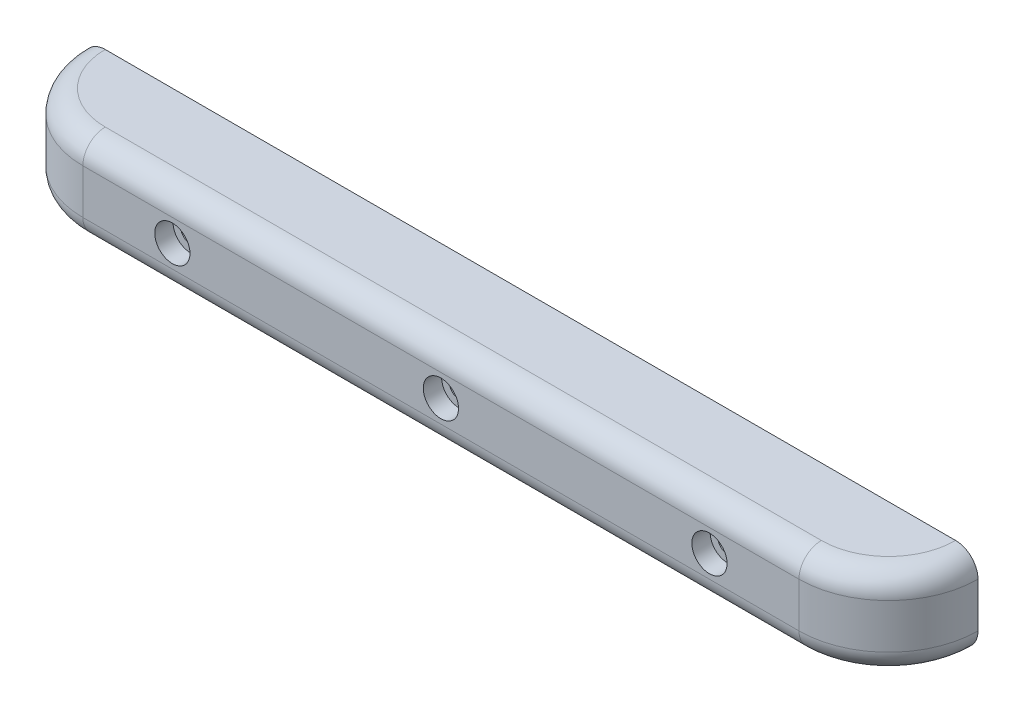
ISO-10303-21;
HEADER;
FILE_DESCRIPTION(('STEP AP214'),'2;1');
FILE_NAME('part.step','',(''),(''),'','','');
FILE_SCHEMA(('AUTOMOTIVE_DESIGN { 1 0 10303 214 1 1 1 1 }'));
ENDSEC;
DATA;
#1=APPLICATION_CONTEXT('core data for automotive mechanical design processes');
#2=APPLICATION_PROTOCOL_DEFINITION('international standard','automotive_design',2000,#1);
#3=PRODUCT_CONTEXT('',#1,'mechanical');
#4=PRODUCT('Part','Part','',(#3));
#5=PRODUCT_RELATED_PRODUCT_CATEGORY('part','',(#4));
#6=PRODUCT_DEFINITION_FORMATION('','',#4);
#7=PRODUCT_DEFINITION_CONTEXT('part definition',#1,'design');
#8=PRODUCT_DEFINITION('design','',#6,#7);
#9=PRODUCT_DEFINITION_SHAPE('','',#8);
#10=(LENGTH_UNIT() NAMED_UNIT(*) SI_UNIT(.MILLI.,.METRE.));
#11=(NAMED_UNIT(*) PLANE_ANGLE_UNIT() SI_UNIT($,.RADIAN.));
#12=(NAMED_UNIT(*) SI_UNIT($,.STERADIAN.) SOLID_ANGLE_UNIT());
#13=UNCERTAINTY_MEASURE_WITH_UNIT(LENGTH_MEASURE(1.E-05),#10,'distance_accuracy_value','');
#14=(GEOMETRIC_REPRESENTATION_CONTEXT(3) GLOBAL_UNCERTAINTY_ASSIGNED_CONTEXT((#13)) GLOBAL_UNIT_ASSIGNED_CONTEXT((#10,
#11,#12)) REPRESENTATION_CONTEXT('',''));
#15=CARTESIAN_POINT('',(0.,0.,0.));
#16=DIRECTION('',(0.,0.,1.));
#17=DIRECTION('',(1.,0.,0.));
#18=AXIS2_PLACEMENT_3D('',#15,#16,#17);
#19=CARTESIAN_POINT('',(-127.,12.7,0.));
#20=DIRECTION('',(0.,0.,-1.));
#21=DIRECTION('',(-1.,0.,0.));
#22=AXIS2_PLACEMENT_3D('',#19,#20,#21);
#23=PLANE('',#22);
#24=CARTESIAN_POINT('',(0.,0.,0.));
#25=DIRECTION('',(0.,0.,1.));
#26=DIRECTION('',(1.,0.,0.));
#27=AXIS2_PLACEMENT_3D('',#24,#25,#26);
#28=CIRCLE('',#27,2.84999999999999);
#29=CARTESIAN_POINT('',(2.84999999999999,0.,0.));
#30=VERTEX_POINT('',#29);
#31=EDGE_CURVE('E288',#30,#30,#28,.T.);
#32=ORIENTED_EDGE('',*,*,#31,.T.);
#33=EDGE_LOOP('',(#32));
#34=FACE_BOUND('',#33,.T.);
#35=DIRECTION('',(1.,0.,0.));
#36=VECTOR('',#35,1.);
#37=CARTESIAN_POINT('',(-127.,-12.7,0.));
#38=LINE('',#37,#36);
#39=CARTESIAN_POINT('',(-120.65,-12.7,0.));
#40=VERTEX_POINT('',#39);
#41=CARTESIAN_POINT('',(120.65,-12.7,0.));
#42=VERTEX_POINT('',#41);
#43=EDGE_CURVE('E126',#40,#42,#38,.T.);
#44=ORIENTED_EDGE('',*,*,#43,.F.);
#45=CARTESIAN_POINT('',(-120.65,-6.35,0.));
#46=DIRECTION('',(0.,0.,-1.));
#47=DIRECTION('',(-1.,0.,0.));
#48=AXIS2_PLACEMENT_3D('',#45,#46,#47);
#49=CIRCLE('',#48,6.35);
#50=CARTESIAN_POINT('',(-127.,-6.35,0.));
#51=VERTEX_POINT('',#50);
#52=EDGE_CURVE('E125',#40,#51,#49,.T.);
#53=ORIENTED_EDGE('',*,*,#52,.T.);
#54=DIRECTION('',(0.,-1.,0.));
#55=VECTOR('',#54,1.);
#56=CARTESIAN_POINT('',(-127.,-12.7,0.));
#57=LINE('',#56,#55);
#58=CARTESIAN_POINT('',(-127.,6.35,0.));
#59=VERTEX_POINT('',#58);
#60=EDGE_CURVE('E109',#59,#51,#57,.T.);
#61=ORIENTED_EDGE('',*,*,#60,.F.);
#62=CARTESIAN_POINT('',(-120.65,6.35,0.));
#63=DIRECTION('',(0.,0.,-1.));
#64=DIRECTION('',(-1.,0.,0.));
#65=AXIS2_PLACEMENT_3D('',#62,#63,#64);
#66=CIRCLE('',#65,6.35);
#67=CARTESIAN_POINT('',(-120.65,12.7,0.));
#68=VERTEX_POINT('',#67);
#69=EDGE_CURVE('E123',#59,#68,#66,.T.);
#70=ORIENTED_EDGE('',*,*,#69,.T.);
#71=DIRECTION('',(-1.,0.,0.));
#72=VECTOR('',#71,1.);
#73=CARTESIAN_POINT('',(-127.,12.7,0.));
#74=LINE('',#73,#72);
#75=CARTESIAN_POINT('',(120.65,12.7,0.));
#76=VERTEX_POINT('',#75);
#77=EDGE_CURVE('E117',#76,#68,#74,.T.);
#78=ORIENTED_EDGE('',*,*,#77,.F.);
#79=CARTESIAN_POINT('',(120.65,6.35,0.));
#80=DIRECTION('',(0.,0.,-1.));
#81=DIRECTION('',(-1.,0.,0.));
#82=AXIS2_PLACEMENT_3D('',#79,#80,#81);
#83=CIRCLE('',#82,6.35);
#84=CARTESIAN_POINT('',(127.,6.35,0.));
#85=VERTEX_POINT('',#84);
#86=EDGE_CURVE('E130',#76,#85,#83,.T.);
#87=ORIENTED_EDGE('',*,*,#86,.T.);
#88=DIRECTION('',(0.,1.,0.));
#89=VECTOR('',#88,1.);
#90=CARTESIAN_POINT('',(127.,-12.7,0.));
#91=LINE('',#90,#89);
#92=CARTESIAN_POINT('',(127.,-6.35,0.));
#93=VERTEX_POINT('',#92);
#94=EDGE_CURVE('E165',#93,#85,#91,.T.);
#95=ORIENTED_EDGE('',*,*,#94,.F.);
#96=CARTESIAN_POINT('',(120.65,-6.35,0.));
#97=DIRECTION('',(0.,0.,-1.));
#98=DIRECTION('',(-1.,0.,0.));
#99=AXIS2_PLACEMENT_3D('',#96,#97,#98);
#100=CIRCLE('',#99,6.35);
#101=EDGE_CURVE('E133',#93,#42,#100,.T.);
#102=ORIENTED_EDGE('',*,*,#101,.T.);
#103=EDGE_LOOP('',(#44,#53,#61,#70,#78,#87,#95,#102));
#104=FACE_BOUND('',#103,.T.);
#105=CARTESIAN_POINT('',(-76.2,0.,0.));
#106=DIRECTION('',(0.,0.,1.));
#107=DIRECTION('',(1.,0.,0.));
#108=AXIS2_PLACEMENT_3D('',#105,#106,#107);
#109=CIRCLE('',#108,2.84999999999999);
#110=CARTESIAN_POINT('',(-73.35,0.,0.));
#111=VERTEX_POINT('',#110);
#112=EDGE_CURVE('E299',#111,#111,#109,.T.);
#113=ORIENTED_EDGE('',*,*,#112,.T.);
#114=EDGE_LOOP('',(#113));
#115=FACE_BOUND('',#114,.T.);
#116=CARTESIAN_POINT('',(76.2,0.,0.));
#117=DIRECTION('',(0.,0.,1.));
#118=DIRECTION('',(1.,0.,0.));
#119=AXIS2_PLACEMENT_3D('',#116,#117,#118);
#120=CIRCLE('',#119,2.84999999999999);
#121=CARTESIAN_POINT('',(79.05,0.,0.));
#122=VERTEX_POINT('',#121);
#123=EDGE_CURVE('E275',#122,#122,#120,.T.);
#124=ORIENTED_EDGE('',*,*,#123,.T.);
#125=EDGE_LOOP('',(#124));
#126=FACE_BOUND('',#125,.T.);
#127=ADVANCED_FACE('F40',(#34,#104,#115,#126),#23,.T.);
#128=CARTESIAN_POINT('',(-127.,12.7,25.4));
#129=DIRECTION('',(0.,0.,-1.));
#130=DIRECTION('',(-1.,0.,0.));
#131=AXIS2_PLACEMENT_3D('',#128,#129,#130);
#132=PLANE('',#131);
#133=CARTESIAN_POINT('',(76.2,0.,25.4));
#134=DIRECTION('',(0.,0.,1.));
#135=DIRECTION('',(1.,0.,0.));
#136=AXIS2_PLACEMENT_3D('',#133,#134,#135);
#137=CIRCLE('',#136,5.);
#138=CARTESIAN_POINT('',(81.2,0.,25.4));
#139=VERTEX_POINT('',#138);
#140=EDGE_CURVE('E282',#139,#139,#137,.T.);
#141=ORIENTED_EDGE('',*,*,#140,.F.);
#142=EDGE_LOOP('',(#141));
#143=FACE_BOUND('',#142,.T.);
#144=CARTESIAN_POINT('',(0.,0.,25.4));
#145=DIRECTION('',(0.,0.,1.));
#146=DIRECTION('',(1.,0.,0.));
#147=AXIS2_PLACEMENT_3D('',#144,#145,#146);
#148=CIRCLE('',#147,5.);
#149=CARTESIAN_POINT('',(5.,0.,25.4));
#150=VERTEX_POINT('',#149);
#151=EDGE_CURVE('E296',#150,#150,#148,.T.);
#152=ORIENTED_EDGE('',*,*,#151,.F.);
#153=EDGE_LOOP('',(#152));
#154=FACE_BOUND('',#153,.T.);
#155=CARTESIAN_POINT('',(-76.2,0.,25.4));
#156=DIRECTION('',(0.,0.,1.));
#157=DIRECTION('',(1.,0.,0.));
#158=AXIS2_PLACEMENT_3D('',#155,#156,#157);
#159=CIRCLE('',#158,5.);
#160=CARTESIAN_POINT('',(-71.2,0.,25.4));
#161=VERTEX_POINT('',#160);
#162=EDGE_CURVE('E169',#161,#161,#159,.T.);
#163=ORIENTED_EDGE('',*,*,#162,.F.);
#164=EDGE_LOOP('',(#163));
#165=FACE_BOUND('',#164,.T.);
#166=DIRECTION('',(0.,1.,0.));
#167=VECTOR('',#166,1.);
#168=CARTESIAN_POINT('',(-101.6,-12.7,25.4));
#169=LINE('',#168,#167);
#170=CARTESIAN_POINT('',(-101.6,-6.35,25.4));
#171=VERTEX_POINT('',#170);
#172=CARTESIAN_POINT('',(-101.6,6.35,25.4));
#173=VERTEX_POINT('',#172);
#174=EDGE_CURVE('E112',#171,#173,#169,.T.);
#175=ORIENTED_EDGE('',*,*,#174,.F.);
#176=DIRECTION('',(1.,0.,0.));
#177=VECTOR('',#176,1.);
#178=CARTESIAN_POINT('',(-127.,-6.35,25.4));
#179=LINE('',#178,#177);
#180=CARTESIAN_POINT('',(101.6,-6.35,25.4));
#181=VERTEX_POINT('',#180);
#182=EDGE_CURVE('E11',#171,#181,#179,.T.);
#183=ORIENTED_EDGE('',*,*,#182,.T.);
#184=DIRECTION('',(0.,1.,0.));
#185=VECTOR('',#184,1.);
#186=CARTESIAN_POINT('',(101.6,-12.7,25.4));
#187=LINE('',#186,#185);
#188=CARTESIAN_POINT('',(101.6,6.35,25.4));
#189=VERTEX_POINT('',#188);
#190=EDGE_CURVE('E127',#181,#189,#187,.T.);
#191=ORIENTED_EDGE('',*,*,#190,.T.);
#192=DIRECTION('',(-1.,0.,0.));
#193=VECTOR('',#192,1.);
#194=CARTESIAN_POINT('',(-127.,6.35,25.4));
#195=LINE('',#194,#193);
#196=EDGE_CURVE('E48',#189,#173,#195,.T.);
#197=ORIENTED_EDGE('',*,*,#196,.T.);
#198=EDGE_LOOP('',(#175,#183,#191,#197));
#199=FACE_BOUND('',#198,.T.);
#200=ADVANCED_FACE('F152',(#143,#154,#165,#199),#132,.F.);
#201=CARTESIAN_POINT('',(-127.,-12.7,25.4));
#202=DIRECTION('',(0.,1.,0.));
#203=DIRECTION('',(0.,0.,1.));
#204=AXIS2_PLACEMENT_3D('',#201,#202,#203);
#205=PLANE('',#204);
#206=DIRECTION('',(1.,0.,0.));
#207=VECTOR('',#206,1.);
#208=CARTESIAN_POINT('',(-127.,-12.7,19.05));
#209=LINE('',#208,#207);
#210=CARTESIAN_POINT('',(101.6,-12.7,19.05));
#211=VERTEX_POINT('',#210);
#212=CARTESIAN_POINT('',(-101.6,-12.7,19.05));
#213=VERTEX_POINT('',#212);
#214=EDGE_CURVE('E189',#211,#213,#209,.F.);
#215=ORIENTED_EDGE('',*,*,#214,.T.);
#216=CARTESIAN_POINT('',(-101.6,-12.7,0.));
#217=DIRECTION('',(0.,1.,0.));
#218=DIRECTION('',(0.,0.,1.));
#219=AXIS2_PLACEMENT_3D('',#216,#217,#218);
#220=CIRCLE('',#219,19.05);
#221=EDGE_CURVE('E131',#213,#40,#220,.F.);
#222=ORIENTED_EDGE('',*,*,#221,.T.);
#223=ORIENTED_EDGE('',*,*,#43,.T.);
#224=CARTESIAN_POINT('',(101.6,-12.7,0.));
#225=DIRECTION('',(0.,1.,0.));
#226=DIRECTION('',(0.,0.,1.));
#227=AXIS2_PLACEMENT_3D('',#224,#225,#226);
#228=CIRCLE('',#227,19.05);
#229=EDGE_CURVE('E135',#42,#211,#228,.F.);
#230=ORIENTED_EDGE('',*,*,#229,.T.);
#231=EDGE_LOOP('',(#215,#222,#223,#230));
#232=FACE_BOUND('',#231,.T.);
#233=ADVANCED_FACE('F42',(#232),#205,.F.);
#234=CARTESIAN_POINT('',(-127.,12.7,25.4));
#235=DIRECTION('',(0.,-1.,0.));
#236=DIRECTION('',(0.,0.,-1.));
#237=AXIS2_PLACEMENT_3D('',#234,#235,#236);
#238=PLANE('',#237);
#239=DIRECTION('',(-1.,0.,0.));
#240=VECTOR('',#239,1.);
#241=CARTESIAN_POINT('',(-127.,12.7,19.05));
#242=LINE('',#241,#240);
#243=CARTESIAN_POINT('',(-101.6,12.7,19.05));
#244=VERTEX_POINT('',#243);
#245=CARTESIAN_POINT('',(101.6,12.7,19.05));
#246=VERTEX_POINT('',#245);
#247=EDGE_CURVE('E55',#244,#246,#242,.F.);
#248=ORIENTED_EDGE('',*,*,#247,.T.);
#249=CARTESIAN_POINT('',(101.6,12.7,0.));
#250=DIRECTION('',(0.,-1.,0.));
#251=DIRECTION('',(0.,0.,-1.));
#252=AXIS2_PLACEMENT_3D('',#249,#250,#251);
#253=CIRCLE('',#252,19.05);
#254=EDGE_CURVE('E148',#246,#76,#253,.F.);
#255=ORIENTED_EDGE('',*,*,#254,.T.);
#256=ORIENTED_EDGE('',*,*,#77,.T.);
#257=CARTESIAN_POINT('',(-101.6,12.7,0.));
#258=DIRECTION('',(0.,-1.,0.));
#259=DIRECTION('',(0.,0.,-1.));
#260=AXIS2_PLACEMENT_3D('',#257,#258,#259);
#261=CIRCLE('',#260,19.05);
#262=EDGE_CURVE('E60',#68,#244,#261,.F.);
#263=ORIENTED_EDGE('',*,*,#262,.T.);
#264=EDGE_LOOP('',(#248,#255,#256,#263));
#265=FACE_BOUND('',#264,.T.);
#266=ADVANCED_FACE('F204',(#265),#238,.F.);
#267=CARTESIAN_POINT('',(101.6,-12.7,0.));
#268=DIRECTION('',(0.,1.,0.));
#269=DIRECTION('',(0.,0.,1.));
#270=AXIS2_PLACEMENT_3D('',#267,#268,#269);
#271=CYLINDRICAL_SURFACE('',#270,25.4);
#272=ORIENTED_EDGE('',*,*,#190,.F.);
#273=CARTESIAN_POINT('',(101.6,-6.35,0.));
#274=DIRECTION('',(0.,1.,0.));
#275=DIRECTION('',(0.,0.,1.));
#276=AXIS2_PLACEMENT_3D('',#273,#274,#275);
#277=CIRCLE('',#276,25.4);
#278=EDGE_CURVE('E144',#181,#93,#277,.T.);
#279=ORIENTED_EDGE('',*,*,#278,.T.);
#280=ORIENTED_EDGE('',*,*,#94,.T.);
#281=CARTESIAN_POINT('',(101.6,6.35,0.));
#282=DIRECTION('',(0.,-1.,0.));
#283=DIRECTION('',(0.,0.,-1.));
#284=AXIS2_PLACEMENT_3D('',#281,#282,#283);
#285=CIRCLE('',#284,25.4);
#286=EDGE_CURVE('E141',#85,#189,#285,.T.);
#287=ORIENTED_EDGE('',*,*,#286,.T.);
#288=EDGE_LOOP('',(#272,#279,#280,#287));
#289=FACE_BOUND('',#288,.T.);
#290=ADVANCED_FACE('F162',(#289),#271,.T.);
#291=CARTESIAN_POINT('',(-101.6,-12.7,0.));
#292=DIRECTION('',(0.,1.,0.));
#293=DIRECTION('',(0.,0.,1.));
#294=AXIS2_PLACEMENT_3D('',#291,#292,#293);
#295=CYLINDRICAL_SURFACE('',#294,25.4);
#296=ORIENTED_EDGE('',*,*,#60,.T.);
#297=CARTESIAN_POINT('',(-101.6,-6.35,0.));
#298=DIRECTION('',(0.,1.,0.));
#299=DIRECTION('',(0.,0.,1.));
#300=AXIS2_PLACEMENT_3D('',#297,#298,#299);
#301=CIRCLE('',#300,25.4);
#302=EDGE_CURVE('E116',#51,#171,#301,.T.);
#303=ORIENTED_EDGE('',*,*,#302,.T.);
#304=ORIENTED_EDGE('',*,*,#174,.T.);
#305=CARTESIAN_POINT('',(-101.6,6.35,0.));
#306=DIRECTION('',(0.,-1.,0.));
#307=DIRECTION('',(0.,0.,-1.));
#308=AXIS2_PLACEMENT_3D('',#305,#306,#307);
#309=CIRCLE('',#308,25.4);
#310=EDGE_CURVE('E105',#173,#59,#309,.T.);
#311=ORIENTED_EDGE('',*,*,#310,.T.);
#312=EDGE_LOOP('',(#296,#303,#304,#311));
#313=FACE_BOUND('',#312,.T.);
#314=ADVANCED_FACE('F107',(#313),#295,.T.);
#315=CARTESIAN_POINT('',(101.6,-6.35,0.));
#316=DIRECTION('',(0.,1.,0.));
#317=DIRECTION('',(0.,0.,1.));
#318=AXIS2_PLACEMENT_3D('',#315,#316,#317);
#319=TOROIDAL_SURFACE('',#318,19.05,6.35);
#320=ORIENTED_EDGE('',*,*,#101,.F.);
#321=ORIENTED_EDGE('',*,*,#278,.F.);
#322=CARTESIAN_POINT('',(101.6,-6.35,19.05));
#323=DIRECTION('',(-1.,0.,0.));
#324=DIRECTION('',(0.,0.,1.));
#325=AXIS2_PLACEMENT_3D('',#322,#323,#324);
#326=CIRCLE('',#325,6.35);
#327=EDGE_CURVE('E179',#211,#181,#326,.T.);
#328=ORIENTED_EDGE('',*,*,#327,.F.);
#329=ORIENTED_EDGE('',*,*,#229,.F.);
#330=EDGE_LOOP('',(#320,#321,#328,#329));
#331=FACE_BOUND('',#330,.T.);
#332=ADVANCED_FACE('F197',(#331),#319,.T.);
#333=CARTESIAN_POINT('',(-127.,-6.35,19.05));
#334=DIRECTION('',(1.,0.,0.));
#335=DIRECTION('',(0.,0.,-1.));
#336=AXIS2_PLACEMENT_3D('',#333,#334,#335);
#337=CYLINDRICAL_SURFACE('',#336,6.35);
#338=ORIENTED_EDGE('',*,*,#327,.T.);
#339=ORIENTED_EDGE('',*,*,#182,.F.);
#340=CARTESIAN_POINT('',(-101.6,-6.35,19.05));
#341=DIRECTION('',(-1.,0.,0.));
#342=DIRECTION('',(0.,0.,1.));
#343=AXIS2_PLACEMENT_3D('',#340,#341,#342);
#344=CIRCLE('',#343,6.35);
#345=EDGE_CURVE('E171',#213,#171,#344,.T.);
#346=ORIENTED_EDGE('',*,*,#345,.F.);
#347=ORIENTED_EDGE('',*,*,#214,.F.);
#348=EDGE_LOOP('',(#338,#339,#346,#347));
#349=FACE_BOUND('',#348,.T.);
#350=ADVANCED_FACE('F201',(#349),#337,.T.);
#351=CARTESIAN_POINT('',(-101.6,-6.35,0.));
#352=DIRECTION('',(0.,1.,0.));
#353=DIRECTION('',(0.,0.,1.));
#354=AXIS2_PLACEMENT_3D('',#351,#352,#353);
#355=TOROIDAL_SURFACE('',#354,19.05,6.35);
#356=ORIENTED_EDGE('',*,*,#52,.F.);
#357=ORIENTED_EDGE('',*,*,#221,.F.);
#358=ORIENTED_EDGE('',*,*,#345,.T.);
#359=ORIENTED_EDGE('',*,*,#302,.F.);
#360=EDGE_LOOP('',(#356,#357,#358,#359));
#361=FACE_BOUND('',#360,.T.);
#362=ADVANCED_FACE('F203',(#361),#355,.T.);
#363=CARTESIAN_POINT('',(-101.6,6.35,0.));
#364=DIRECTION('',(0.,-1.,0.));
#365=DIRECTION('',(0.,0.,-1.));
#366=AXIS2_PLACEMENT_3D('',#363,#364,#365);
#367=TOROIDAL_SURFACE('',#366,19.05,6.35);
#368=ORIENTED_EDGE('',*,*,#69,.F.);
#369=ORIENTED_EDGE('',*,*,#310,.F.);
#370=CARTESIAN_POINT('',(-101.6,6.35,19.05));
#371=DIRECTION('',(1.,0.,0.));
#372=DIRECTION('',(0.,0.,-1.));
#373=AXIS2_PLACEMENT_3D('',#370,#371,#372);
#374=CIRCLE('',#373,6.35);
#375=EDGE_CURVE('E158',#244,#173,#374,.T.);
#376=ORIENTED_EDGE('',*,*,#375,.F.);
#377=ORIENTED_EDGE('',*,*,#262,.F.);
#378=EDGE_LOOP('',(#368,#369,#376,#377));
#379=FACE_BOUND('',#378,.T.);
#380=ADVANCED_FACE('F129',(#379),#367,.T.);
#381=CARTESIAN_POINT('',(-127.,6.35,19.05));
#382=DIRECTION('',(-1.,0.,0.));
#383=DIRECTION('',(0.,0.,1.));
#384=AXIS2_PLACEMENT_3D('',#381,#382,#383);
#385=CYLINDRICAL_SURFACE('',#384,6.35);
#386=ORIENTED_EDGE('',*,*,#375,.T.);
#387=ORIENTED_EDGE('',*,*,#196,.F.);
#388=CARTESIAN_POINT('',(101.6,6.35,19.05));
#389=DIRECTION('',(1.,0.,0.));
#390=DIRECTION('',(0.,0.,-1.));
#391=AXIS2_PLACEMENT_3D('',#388,#389,#390);
#392=CIRCLE('',#391,6.35);
#393=EDGE_CURVE('E157',#246,#189,#392,.T.);
#394=ORIENTED_EDGE('',*,*,#393,.F.);
#395=ORIENTED_EDGE('',*,*,#247,.F.);
#396=EDGE_LOOP('',(#386,#387,#394,#395));
#397=FACE_BOUND('',#396,.T.);
#398=ADVANCED_FACE('F156',(#397),#385,.T.);
#399=CARTESIAN_POINT('',(101.6,6.35,0.));
#400=DIRECTION('',(0.,-1.,0.));
#401=DIRECTION('',(0.,0.,-1.));
#402=AXIS2_PLACEMENT_3D('',#399,#400,#401);
#403=TOROIDAL_SURFACE('',#402,19.05,6.35);
#404=ORIENTED_EDGE('',*,*,#86,.F.);
#405=ORIENTED_EDGE('',*,*,#254,.F.);
#406=ORIENTED_EDGE('',*,*,#393,.T.);
#407=ORIENTED_EDGE('',*,*,#286,.F.);
#408=EDGE_LOOP('',(#404,#405,#406,#407));
#409=FACE_BOUND('',#408,.T.);
#410=ADVANCED_FACE('F168',(#409),#403,.T.);
#411=CARTESIAN_POINT('',(-76.2,0.,25.4));
#412=DIRECTION('',(0.,0.,1.));
#413=DIRECTION('',(1.,0.,0.));
#414=AXIS2_PLACEMENT_3D('',#411,#412,#413);
#415=CYLINDRICAL_SURFACE('',#414,5.);
#416=CARTESIAN_POINT('',(-76.2,0.,20.2));
#417=DIRECTION('',(0.,0.,1.));
#418=DIRECTION('',(1.,0.,0.));
#419=AXIS2_PLACEMENT_3D('',#416,#417,#418);
#420=CIRCLE('',#419,5.);
#421=CARTESIAN_POINT('',(-71.2,0.,20.2));
#422=VERTEX_POINT('',#421);
#423=EDGE_CURVE('E174',#422,#422,#420,.T.);
#424=ORIENTED_EDGE('',*,*,#423,.F.);
#425=EDGE_LOOP('',(#424));
#426=FACE_BOUND('',#425,.T.);
#427=ORIENTED_EDGE('',*,*,#162,.T.);
#428=EDGE_LOOP('',(#427));
#429=FACE_BOUND('',#428,.T.);
#430=ADVANCED_FACE('F235',(#426,#429),#415,.F.);
#431=CARTESIAN_POINT('',(-73.35,0.,20.2));
#432=DIRECTION('',(0.,0.,-1.));
#433=DIRECTION('',(-1.,0.,0.));
#434=AXIS2_PLACEMENT_3D('',#431,#432,#433);
#435=PLANE('',#434);
#436=CARTESIAN_POINT('',(-76.2,0.,20.2));
#437=DIRECTION('',(0.,0.,1.));
#438=DIRECTION('',(1.,0.,0.));
#439=AXIS2_PLACEMENT_3D('',#436,#437,#438);
#440=CIRCLE('',#439,2.85000000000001);
#441=CARTESIAN_POINT('',(-73.35,0.,20.2));
#442=VERTEX_POINT('',#441);
#443=EDGE_CURVE('E302',#442,#442,#440,.T.);
#444=ORIENTED_EDGE('',*,*,#443,.F.);
#445=EDGE_LOOP('',(#444));
#446=FACE_BOUND('',#445,.T.);
#447=ORIENTED_EDGE('',*,*,#423,.T.);
#448=EDGE_LOOP('',(#447));
#449=FACE_BOUND('',#448,.T.);
#450=ADVANCED_FACE('F238',(#446,#449),#435,.F.);
#451=CARTESIAN_POINT('',(-76.2,0.,25.4));
#452=DIRECTION('',(0.,0.,1.));
#453=DIRECTION('',(1.,0.,0.));
#454=AXIS2_PLACEMENT_3D('',#451,#452,#453);
#455=CYLINDRICAL_SURFACE('',#454,2.85);
#456=ORIENTED_EDGE('',*,*,#112,.F.);
#457=EDGE_LOOP('',(#456));
#458=FACE_BOUND('',#457,.T.);
#459=ORIENTED_EDGE('',*,*,#443,.T.);
#460=EDGE_LOOP('',(#459));
#461=FACE_BOUND('',#460,.T.);
#462=ADVANCED_FACE('F242',(#458,#461),#455,.F.);
#463=CARTESIAN_POINT('',(0.,0.,25.4));
#464=DIRECTION('',(0.,0.,1.));
#465=DIRECTION('',(1.,0.,0.));
#466=AXIS2_PLACEMENT_3D('',#463,#464,#465);
#467=CYLINDRICAL_SURFACE('',#466,5.);
#468=CARTESIAN_POINT('',(0.,0.,20.2));
#469=DIRECTION('',(0.,0.,1.));
#470=DIRECTION('',(1.,0.,0.));
#471=AXIS2_PLACEMENT_3D('',#468,#469,#470);
#472=CIRCLE('',#471,5.);
#473=CARTESIAN_POINT('',(5.,0.,20.2));
#474=VERTEX_POINT('',#473);
#475=EDGE_CURVE('E293',#474,#474,#472,.T.);
#476=ORIENTED_EDGE('',*,*,#475,.F.);
#477=EDGE_LOOP('',(#476));
#478=FACE_BOUND('',#477,.T.);
#479=ORIENTED_EDGE('',*,*,#151,.T.);
#480=EDGE_LOOP('',(#479));
#481=FACE_BOUND('',#480,.T.);
#482=ADVANCED_FACE('F246',(#478,#481),#467,.F.);
#483=CARTESIAN_POINT('',(2.85,0.,20.2));
#484=DIRECTION('',(0.,0.,-1.));
#485=DIRECTION('',(-1.,0.,0.));
#486=AXIS2_PLACEMENT_3D('',#483,#484,#485);
#487=PLANE('',#486);
#488=CARTESIAN_POINT('',(0.,0.,20.2));
#489=DIRECTION('',(0.,0.,1.));
#490=DIRECTION('',(1.,0.,0.));
#491=AXIS2_PLACEMENT_3D('',#488,#489,#490);
#492=CIRCLE('',#491,2.85);
#493=CARTESIAN_POINT('',(2.85,0.,20.2));
#494=VERTEX_POINT('',#493);
#495=EDGE_CURVE('E290',#494,#494,#492,.T.);
#496=ORIENTED_EDGE('',*,*,#495,.F.);
#497=EDGE_LOOP('',(#496));
#498=FACE_BOUND('',#497,.T.);
#499=ORIENTED_EDGE('',*,*,#475,.T.);
#500=EDGE_LOOP('',(#499));
#501=FACE_BOUND('',#500,.T.);
#502=ADVANCED_FACE('F250',(#498,#501),#487,.F.);
#503=CARTESIAN_POINT('',(0.,0.,25.4));
#504=DIRECTION('',(0.,0.,1.));
#505=DIRECTION('',(1.,0.,0.));
#506=AXIS2_PLACEMENT_3D('',#503,#504,#505);
#507=CYLINDRICAL_SURFACE('',#506,2.85);
#508=ORIENTED_EDGE('',*,*,#31,.F.);
#509=EDGE_LOOP('',(#508));
#510=FACE_BOUND('',#509,.T.);
#511=ORIENTED_EDGE('',*,*,#495,.T.);
#512=EDGE_LOOP('',(#511));
#513=FACE_BOUND('',#512,.T.);
#514=ADVANCED_FACE('F254',(#510,#513),#507,.F.);
#515=CARTESIAN_POINT('',(76.2,0.,25.4));
#516=DIRECTION('',(0.,0.,1.));
#517=DIRECTION('',(1.,0.,0.));
#518=AXIS2_PLACEMENT_3D('',#515,#516,#517);
#519=CYLINDRICAL_SURFACE('',#518,5.);
#520=CARTESIAN_POINT('',(76.2,0.,20.2));
#521=DIRECTION('',(0.,0.,1.));
#522=DIRECTION('',(1.,0.,0.));
#523=AXIS2_PLACEMENT_3D('',#520,#521,#522);
#524=CIRCLE('',#523,5.);
#525=CARTESIAN_POINT('',(81.2,0.,20.2));
#526=VERTEX_POINT('',#525);
#527=EDGE_CURVE('E279',#526,#526,#524,.T.);
#528=ORIENTED_EDGE('',*,*,#527,.F.);
#529=EDGE_LOOP('',(#528));
#530=FACE_BOUND('',#529,.T.);
#531=ORIENTED_EDGE('',*,*,#140,.T.);
#532=EDGE_LOOP('',(#531));
#533=FACE_BOUND('',#532,.T.);
#534=ADVANCED_FACE('F258',(#530,#533),#519,.F.);
#535=CARTESIAN_POINT('',(79.05,0.,20.2));
#536=DIRECTION('',(0.,0.,-1.));
#537=DIRECTION('',(-1.,0.,0.));
#538=AXIS2_PLACEMENT_3D('',#535,#536,#537);
#539=PLANE('',#538);
#540=CARTESIAN_POINT('',(76.2,0.,20.2));
#541=DIRECTION('',(0.,0.,1.));
#542=DIRECTION('',(1.,0.,0.));
#543=AXIS2_PLACEMENT_3D('',#540,#541,#542);
#544=CIRCLE('',#543,2.85000000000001);
#545=CARTESIAN_POINT('',(79.05,0.,20.2));
#546=VERTEX_POINT('',#545);
#547=EDGE_CURVE('E278',#546,#546,#544,.T.);
#548=ORIENTED_EDGE('',*,*,#547,.F.);
#549=EDGE_LOOP('',(#548));
#550=FACE_BOUND('',#549,.T.);
#551=ORIENTED_EDGE('',*,*,#527,.T.);
#552=EDGE_LOOP('',(#551));
#553=FACE_BOUND('',#552,.T.);
#554=ADVANCED_FACE('F262',(#550,#553),#539,.F.);
#555=CARTESIAN_POINT('',(76.2,0.,25.4));
#556=DIRECTION('',(0.,0.,1.));
#557=DIRECTION('',(1.,0.,0.));
#558=AXIS2_PLACEMENT_3D('',#555,#556,#557);
#559=CYLINDRICAL_SURFACE('',#558,2.85);
#560=ORIENTED_EDGE('',*,*,#123,.F.);
#561=EDGE_LOOP('',(#560));
#562=FACE_BOUND('',#561,.T.);
#563=ORIENTED_EDGE('',*,*,#547,.T.);
#564=EDGE_LOOP('',(#563));
#565=FACE_BOUND('',#564,.T.);
#566=ADVANCED_FACE('F266',(#562,#565),#559,.F.);
#567=CLOSED_SHELL('',(#127,#200,#233,#266,#290,#314,#332,#350,#362,#380,#398,#410,#430,#450,
#462,#482,#502,#514,#534,#554,#566));
#568=MANIFOLD_SOLID_BREP('B2',#567);
#569=ADVANCED_BREP_SHAPE_REPRESENTATION('',(#18,#568),#14);
#570=SHAPE_DEFINITION_REPRESENTATION(#9,#569);
ENDSEC;
END-ISO-10303-21;
